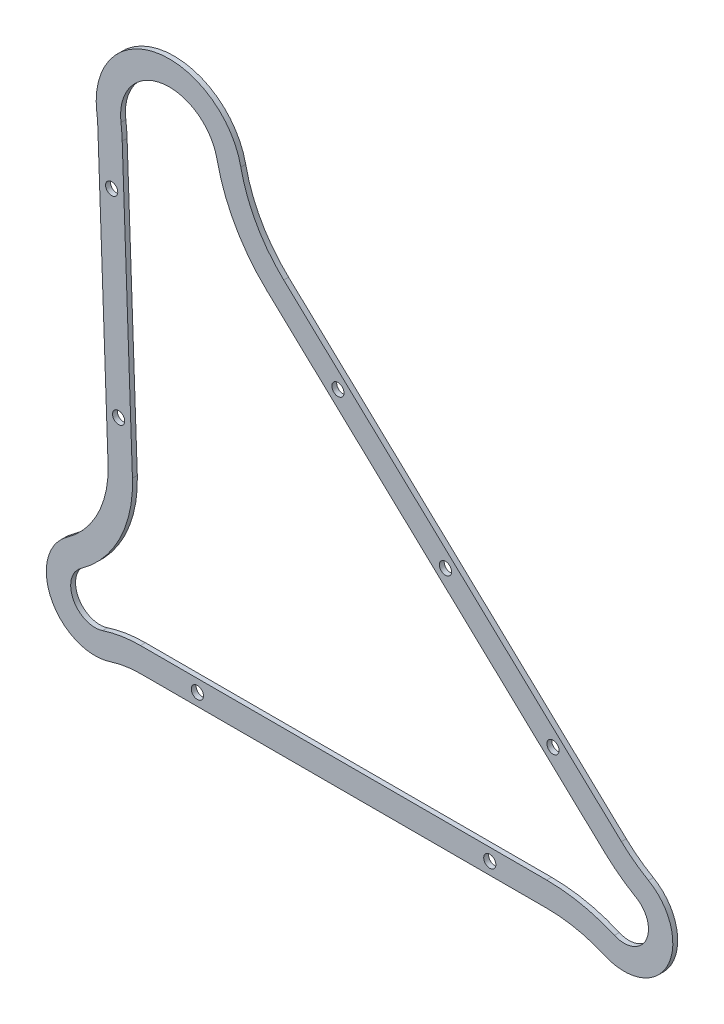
from build123d import *

# Parameters (mm, degrees)
EXTRUDE1_DEPTH     = 2.54
SKETCH2_R          = 3.175
CUT_EXTRUDE1_DEPTH = 251.692342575


with BuildPart() as part:
    # Sketch1 → Extrude1 (new body)
    with BuildSketch(Plane.XY):
        with BuildLine():
            Line((104.249868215, -78.575784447), (-71.737786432, 86.88652235))
            ThreePointArc((-71.737786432, 86.88652235), (-85.972506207, 105.074028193), (-94.104538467, 126.690750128))
            ThreePointArc((-94.104538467, 126.690750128), (-137.733375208, 156.402339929), (-169.178577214, 114.005957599))
            ThreePointArc((-169.178577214, 114.005957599), (-168.816171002, 110.541373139), (-168.612485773, 107.063845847))
            Line((-168.612485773, 107.063845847), (-163.281680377, -42.423416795))
            ThreePointArc((-163.281680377, -42.423416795), (-168.530351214, -66.787210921), (-184.735159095, -85.722553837))
            ThreePointArc((-184.735159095, -85.722553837), (-192.775650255, -117.867716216), (-162.188363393, -130.610512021))
            ThreePointArc((-162.188363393, -130.610512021), (-154.398106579, -128.729835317), (-146.409023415, -128.097699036))
            Line((-146.409023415, -128.097699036), (65.308297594, -128.097699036))
            ThreePointArc((65.308297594, -128.097699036), (80.756662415, -129.680087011), (95.563418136, -134.361530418))
            ThreePointArc((95.563418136, -134.361530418), (128.340887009, -122.460595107), (118.347766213, -89.052029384))
            ThreePointArc((118.347766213, -89.052029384), (110.995958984, -84.221463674), (104.249868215, -78.575784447))
        make_face()
        with BuildLine():
            Line((95.550564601, -87.828466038), (-80.437090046, 77.633840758))
            ThreePointArc((-80.437090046, 77.633840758), (-97.044263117, 98.852597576), (-106.531634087, 124.072106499))
            ThreePointArc((-106.531634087, 124.072106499), (-135.617525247, 143.879833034), (-156.580993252, 115.615578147))
            ThreePointArc((-156.580993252, 115.615578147), (-156.158186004, 111.573562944), (-155.920553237, 107.516447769))
            Line((-155.920553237, 107.516447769), (-150.589747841, -41.970814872))
            ThreePointArc((-150.589747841, -41.970814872), (-157.150586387, -72.42555753), (-177.406596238, -96.094736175))
            ThreePointArc((-177.406596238, -96.094736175), (-181.426841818, -112.167317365), (-166.133198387, -118.538715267))
            ThreePointArc((-166.133198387, -118.538715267), (-156.39537737, -116.187869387), (-146.409023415, -115.397699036))
            Line((-146.409023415, -115.397699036), (65.308297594, -115.397699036))
            ThreePointArc((65.308297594, -115.397699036), (83.331389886, -117.24381834), (100.605938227, -122.705502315))
            ThreePointArc((100.605938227, -122.705502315), (116.994672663, -116.75503466), (111.998112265, -100.050751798))
            ThreePointArc((111.998112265, -100.050751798), (103.421003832, -94.415091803), (95.550564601, -87.828466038))
        make_face(mode=Mode.SUBTRACT)
    extrude(amount=EXTRUDE1_DEPTH)

    # Sketch2 → Cut-Extrude1 (cut, through all)
    with BuildSketch(Plane.XY.offset(2.54)):
        with Locations((-161.411524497, 83.314245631)):
            Circle(SKETCH2_R)
        with Locations((-157.790709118, -18.221214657)):
            Circle(SKETCH2_R)
        with Locations((-43.49801077, 51.619840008)):
            Circle(SKETCH2_R)
        with Locations((12.545781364, -1.072123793)):
            Circle(SKETCH2_R)
        with Locations((68.589573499, -53.764087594)):
            Circle(SKETCH2_R)
        with Locations((35.64963709, -121.747699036)):
            Circle(SKETCH2_R)
        with Locations((-116.75036291, -121.747699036)):
            Circle(SKETCH2_R)
    extrude(amount=-CUT_EXTRUDE1_DEPTH, mode=Mode.SUBTRACT)


solid = part.part
